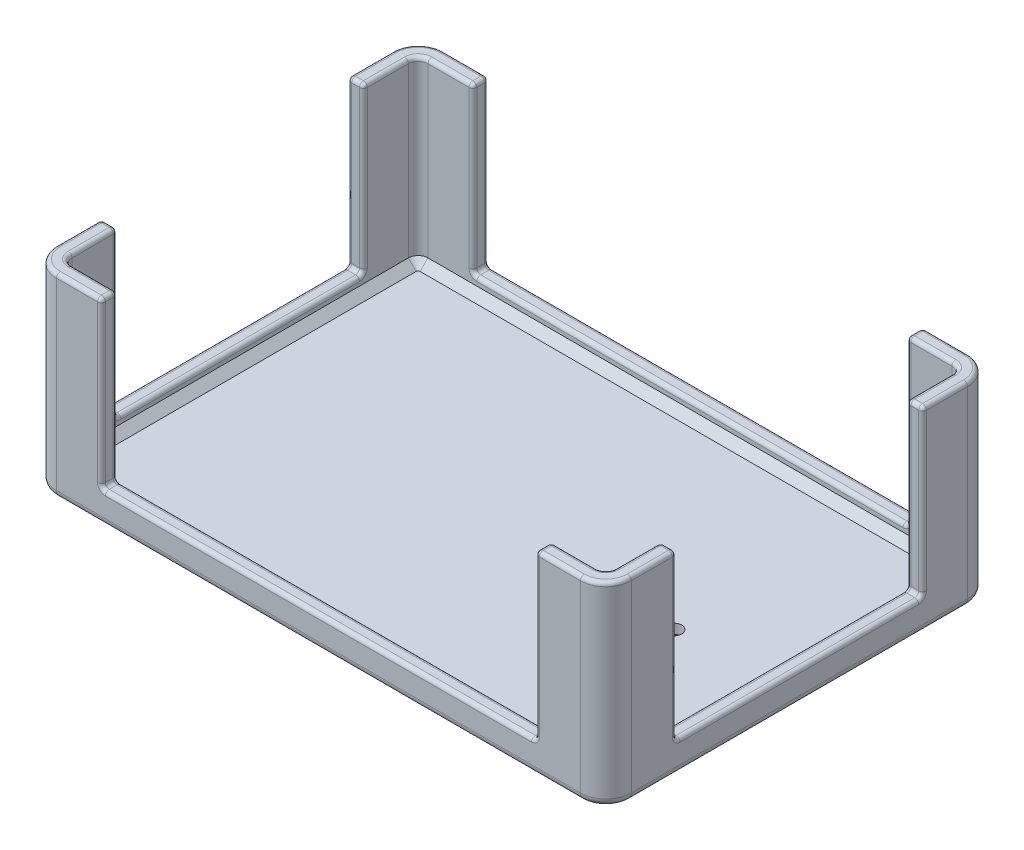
from build123d import *

# Parameters (mm, degrees)
ESTRUSIONE_ESTRUSIONE1_DEPTH = 50
SVUOTA1_T                    = -4
SCHIZZO2_W                   = 63
SCHIZZO2_H                   = 42
TAGLIO_ESTRUSIONE1_DEPTH     = 185.146680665
SCHIZZO3_W                   = 111
SCHIZZO3_H                   = 42
TAGLIO_ESTRUSIONE2_DEPTH     = 185.146680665
SMUSSO1_SIZE                 = 2
RACCORDO1_R                  = 1
RACCORDO2_R                  = 2
SCHIZZO4_R                   = 2
TAGLIO_ESTRUSIONE3_DEPTH     = 184.101065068
SMUSSO3_SIZE                 = 1.5


with BuildPart() as part:
    # Schizzo1 → Estrusione-Estrusione1 (new body)
    with BuildSketch(Plane(origin=(0, 0, 0), x_dir=(1, 0, 0), z_dir=(0, 1, 0))):
        with BuildLine():
            Line((6.5, 0), (140.5, 0))
            ThreePointArc((140.5, 0), (145.096194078, 1.903805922), (147, 6.5))
            Line((147, 6.5), (147, 92.5))
            ThreePointArc((147, 92.5), (145.096194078, 97.096194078), (140.5, 99))
            Line((140.5, 99), (6.5, 99))
            ThreePointArc((6.5, 99), (1.903805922, 97.096194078), (0, 92.5))
            Line((0, 92.5), (0, 6.5))
            ThreePointArc((0, 6.5), (1.903805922, 1.903805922), (6.5, 0))
        make_face()
    extrude(amount=ESTRUSIONE_ESTRUSIONE1_DEPTH)

    # Svuota1
    svuota1_openings = [part.faces().sort_by_distance(p)[0] for p in [
        (73.5, 50, -49.5),
    ]]
    offset(amount=SVUOTA1_T, openings=svuota1_openings, kind=Kind.INTERSECTION)

    # Schizzo2 → Taglio-Estrusione1 (cut, through all)
    with BuildSketch(Plane.ZY):
        with Locations((-49.5, 29)):
            Rectangle(SCHIZZO2_W, SCHIZZO2_H)
    extrude(amount=-TAGLIO_ESTRUSIONE1_DEPTH, mode=Mode.SUBTRACT)

    # Schizzo3 → Taglio-Estrusione2 (cut, through all)
    with BuildSketch(Plane.XY):
        with Locations((73.5, 29)):
            Rectangle(SCHIZZO3_W, SCHIZZO3_H)
    extrude(amount=-TAGLIO_ESTRUSIONE2_DEPTH, mode=Mode.SUBTRACT)

    # Smusso1
    smusso1_edges = [part.edges().sort_by_distance(p)[0] for p in [
        (4.732233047, 4, -4.732233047),
        (73.5, 4, -4),
        (142.267766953, 4, -4.732233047),
        (143, 4, -49.5),
        (142.267766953, 4, -94.267766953),
        (73.5, 4, -95),
        (4.732233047, 4, -94.267766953),
        (4, 4, -49.5),
    ]]
    chamfer(smusso1_edges, length=SMUSSO1_SIZE)

    # Raccordo1
    raccordo1_edges = [part.edges().sort_by_distance(p)[0] for p in [
        (145.096194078, 50, -1.903805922),
        (147, 50, -12.25),
        (145.096194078, 50, -97.096194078),
        (134.75, 50, -99),
        (1.903805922, 50, -97.096194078),
        (0, 50, -86.75),
        (4.732233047, 50, -4.732233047),
        (12.25, 50, -4),
        (142.267766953, 50, -4.732233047),
        (143, 50, -12.25),
        (142.267766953, 50, -94.267766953),
        (134.75, 50, -95),
        (4.732233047, 50, -94.267766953),
        (4, 50, -86.75),
        (1.903805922, 50, -1.903805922),
        (4, 50, -12.25),
        (4, 8, -49.5),
        (4, 29, -18),
        (4, 29, -81),
        (143, 50, -86.75),
        (147, 50, -86.75),
        (0, 50, -12.25),
        (143, 29, -81),
        (147, 29, -81),
        (145, 8, -81),
        (145, 50, -81),
        (143, 29, -18),
        (147, 29, -18),
        (145, 50, -18),
        (143, 8, -49.5),
        (147, 8, -49.5),
        (145, 8, -18),
        (2, 8, -81),
        (2, 50, -81),
        (2, 50, -18),
        (2, 8, -18),
        (0, 29, -81),
        (0, 8, -49.5),
        (0, 29, -18),
        (12.25, 50, 0),
        (12.25, 50, -95),
        (73.5, 8, -95),
        (129, 29, -95),
        (18, 29, -95),
        (134.75, 50, -4),
        (134.75, 50, 0),
        (12.25, 50, -99),
        (18, 29, -4),
        (18, 8, -2),
        (18, 50, -2),
        (129, 29, -4),
        (129, 50, -2),
        (73.5, 8, -4),
        (129, 8, -2),
        (18, 29, -99),
        (18, 8, -97),
        (18, 50, -97),
        (129, 29, -99),
        (129, 50, -97),
        (73.5, 8, -99),
        (129, 8, -97),
        (18, 29, 0),
        (73.5, 8, 0),
        (129, 29, 0),
    ]]
    fillet(raccordo1_edges, radius=RACCORDO1_R)

    # Raccordo2
    raccordo2_edges = [part.edges().sort_by_distance(p)[0] for p in [
        (73.5, 0, 0),
        (1.903805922, 0, -1.903805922),
        (0, 0, -49.5),
        (1.903805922, 0, -97.096194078),
        (73.5, 0, -99),
        (145.096194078, 0, -97.096194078),
        (147, 0, -49.5),
        (145.096194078, 0, -1.903805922),
    ]]
    fillet(raccordo2_edges, radius=RACCORDO2_R)

    # Schizzo4 → Taglio-Estrusione3 (cut, through all)
    with BuildSketch(Plane(origin=(0, 4, 0), x_dir=(1, 0, 0), z_dir=(0, 1, 0))):
        with Locations(Location((118.25, 46.15, 0), (0, 0, 270))):
            Circle(SCHIZZO4_R)
    extrude(amount=-TAGLIO_ESTRUSIONE3_DEPTH, mode=Mode.SUBTRACT)

    # Smusso3
    smusso3_edges = [part.edges().sort_by_distance(p)[0] for p in [
        (118.25, 0, -48.15),
    ]]
    chamfer(smusso3_edges, length=SMUSSO3_SIZE)


solid = part.part
